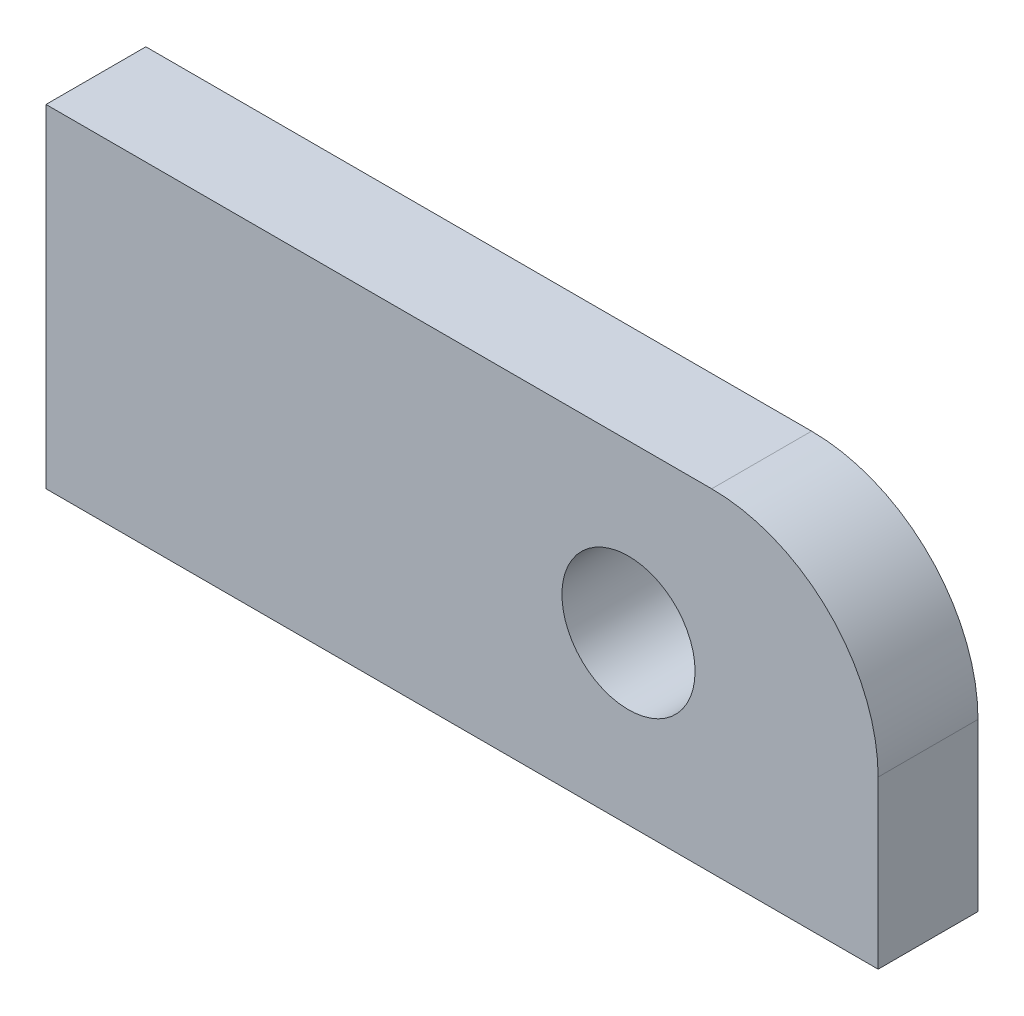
ISO-10303-21;
HEADER;
FILE_DESCRIPTION(('STEP AP214'),'2;1');
FILE_NAME('part.step','',(''),(''),'','','');
FILE_SCHEMA(('AUTOMOTIVE_DESIGN { 1 0 10303 214 1 1 1 1 }'));
ENDSEC;
DATA;
#1=APPLICATION_CONTEXT('core data for automotive mechanical design processes');
#2=APPLICATION_PROTOCOL_DEFINITION('international standard','automotive_design',2000,#1);
#3=PRODUCT_CONTEXT('',#1,'mechanical');
#4=PRODUCT('Part','Part','',(#3));
#5=PRODUCT_RELATED_PRODUCT_CATEGORY('part','',(#4));
#6=PRODUCT_DEFINITION_FORMATION('','',#4);
#7=PRODUCT_DEFINITION_CONTEXT('part definition',#1,'design');
#8=PRODUCT_DEFINITION('design','',#6,#7);
#9=PRODUCT_DEFINITION_SHAPE('','',#8);
#10=(LENGTH_UNIT() NAMED_UNIT(*) SI_UNIT(.MILLI.,.METRE.));
#11=(NAMED_UNIT(*) PLANE_ANGLE_UNIT() SI_UNIT($,.RADIAN.));
#12=(NAMED_UNIT(*) SI_UNIT($,.STERADIAN.) SOLID_ANGLE_UNIT());
#13=UNCERTAINTY_MEASURE_WITH_UNIT(LENGTH_MEASURE(1.E-05),#10,'distance_accuracy_value','');
#14=(GEOMETRIC_REPRESENTATION_CONTEXT(3) GLOBAL_UNCERTAINTY_ASSIGNED_CONTEXT((#13)) GLOBAL_UNIT_ASSIGNED_CONTEXT((#10,
#11,#12)) REPRESENTATION_CONTEXT('',''));
#15=CARTESIAN_POINT('',(0.,0.,0.));
#16=DIRECTION('',(0.,0.,1.));
#17=DIRECTION('',(1.,0.,0.));
#18=AXIS2_PLACEMENT_3D('',#15,#16,#17);
#19=CARTESIAN_POINT('',(80.,19.9999999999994,12.0000000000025));
#20=DIRECTION('',(0.,0.,1.));
#21=DIRECTION('',(1.,0.,0.));
#22=AXIS2_PLACEMENT_3D('',#19,#20,#21);
#23=PLANE('',#22);
#24=DIRECTION('',(0.,-1.,0.));
#25=VECTOR('',#24,1.);
#26=CARTESIAN_POINT('',(0.,0.,12.));
#27=LINE('',#26,#25);
#28=CARTESIAN_POINT('',(-3.88578058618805E-13,40.,12.));
#29=VERTEX_POINT('',#28);
#30=CARTESIAN_POINT('',(0.,0.,12.));
#31=VERTEX_POINT('',#30);
#32=EDGE_CURVE('E107',#29,#31,#27,.T.);
#33=ORIENTED_EDGE('',*,*,#32,.T.);
#34=DIRECTION('',(1.,0.,0.));
#35=VECTOR('',#34,1.);
#36=CARTESIAN_POINT('',(0.,0.,12.));
#37=LINE('',#36,#35);
#38=CARTESIAN_POINT('',(100.,-6.10622663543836E-13,12.0000000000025));
#39=VERTEX_POINT('',#38);
#40=EDGE_CURVE('E90',#31,#39,#37,.T.);
#41=ORIENTED_EDGE('',*,*,#40,.T.);
#42=DIRECTION('',(0.,1.,0.));
#43=VECTOR('',#42,1.);
#44=CARTESIAN_POINT('',(100.,-6.10622663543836E-13,12.0000000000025));
#45=LINE('',#44,#43);
#46=CARTESIAN_POINT('',(100.,19.9999999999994,12.0000000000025));
#47=VERTEX_POINT('',#46);
#48=EDGE_CURVE('E110',#39,#47,#45,.T.);
#49=ORIENTED_EDGE('',*,*,#48,.T.);
#50=CARTESIAN_POINT('',(80.,19.9999999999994,12.0000000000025));
#51=DIRECTION('',(0.,0.,1.));
#52=DIRECTION('',(1.,0.,0.));
#53=AXIS2_PLACEMENT_3D('',#50,#51,#52);
#54=CIRCLE('',#53,20.);
#55=CARTESIAN_POINT('',(80.,40.,12.0000000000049));
#56=VERTEX_POINT('',#55);
#57=EDGE_CURVE('E49',#47,#56,#54,.T.);
#58=ORIENTED_EDGE('',*,*,#57,.T.);
#59=DIRECTION('',(-1.,0.,0.));
#60=VECTOR('',#59,1.);
#61=CARTESIAN_POINT('',(-3.88578058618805E-13,40.,12.));
#62=LINE('',#61,#60);
#63=EDGE_CURVE('E44',#56,#29,#62,.T.);
#64=ORIENTED_EDGE('',*,*,#63,.T.);
#65=EDGE_LOOP('',(#33,#41,#49,#58,#64));
#66=FACE_BOUND('',#65,.T.);
#67=CARTESIAN_POINT('',(70.,19.9999999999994,12.0000000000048));
#68=DIRECTION('',(0.,0.,1.));
#69=DIRECTION('',(1.,0.,0.));
#70=AXIS2_PLACEMENT_3D('',#67,#68,#69);
#71=CIRCLE('',#70,8.00000000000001);
#72=CARTESIAN_POINT('',(78.,19.9999999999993,12.0000000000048));
#73=VERTEX_POINT('',#72);
#74=EDGE_CURVE('E95',#73,#73,#71,.T.);
#75=ORIENTED_EDGE('',*,*,#74,.F.);
#76=EDGE_LOOP('',(#75));
#77=FACE_BOUND('',#76,.T.);
#78=ADVANCED_FACE('F29',(#66,#77),#23,.T.);
#79=CARTESIAN_POINT('',(80.,20.,2.44249065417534E-12));
#80=DIRECTION('',(0.,0.,1.));
#81=DIRECTION('',(1.,0.,0.));
#82=AXIS2_PLACEMENT_3D('',#79,#80,#81);
#83=PLANE('',#82);
#84=DIRECTION('',(0.,-1.,0.));
#85=VECTOR('',#84,1.);
#86=CARTESIAN_POINT('',(0.,0.,0.));
#87=LINE('',#86,#85);
#88=CARTESIAN_POINT('',(0.,40.,0.));
#89=VERTEX_POINT('',#88);
#90=CARTESIAN_POINT('',(0.,0.,0.));
#91=VERTEX_POINT('',#90);
#92=EDGE_CURVE('E81',#89,#91,#87,.T.);
#93=ORIENTED_EDGE('',*,*,#92,.F.);
#94=DIRECTION('',(-1.,0.,0.));
#95=VECTOR('',#94,1.);
#96=CARTESIAN_POINT('',(0.,40.,0.));
#97=LINE('',#96,#95);
#98=CARTESIAN_POINT('',(80.,40.,4.88498130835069E-12));
#99=VERTEX_POINT('',#98);
#100=EDGE_CURVE('E105',#99,#89,#97,.T.);
#101=ORIENTED_EDGE('',*,*,#100,.F.);
#102=CARTESIAN_POINT('',(80.,20.,2.44249065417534E-12));
#103=DIRECTION('',(0.,0.,1.));
#104=DIRECTION('',(1.,0.,0.));
#105=AXIS2_PLACEMENT_3D('',#102,#103,#104);
#106=CIRCLE('',#105,20.);
#107=CARTESIAN_POINT('',(100.,19.9999999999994,2.44249065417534E-12));
#108=VERTEX_POINT('',#107);
#109=EDGE_CURVE('E103',#108,#99,#106,.T.);
#110=ORIENTED_EDGE('',*,*,#109,.F.);
#111=DIRECTION('',(0.,1.,0.));
#112=VECTOR('',#111,1.);
#113=CARTESIAN_POINT('',(100.,-5.96744875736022E-13,2.44249065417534E-12));
#114=LINE('',#113,#112);
#115=CARTESIAN_POINT('',(100.,-5.96744875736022E-13,2.44249065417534E-12));
#116=VERTEX_POINT('',#115);
#117=EDGE_CURVE('E83',#116,#108,#114,.T.);
#118=ORIENTED_EDGE('',*,*,#117,.F.);
#119=DIRECTION('',(1.,0.,0.));
#120=VECTOR('',#119,1.);
#121=CARTESIAN_POINT('',(0.,0.,0.));
#122=LINE('',#121,#120);
#123=EDGE_CURVE('E76',#91,#116,#122,.T.);
#124=ORIENTED_EDGE('',*,*,#123,.F.);
#125=EDGE_LOOP('',(#93,#101,#110,#118,#124));
#126=FACE_BOUND('',#125,.T.);
#127=CARTESIAN_POINT('',(70.,20.,4.88498130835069E-12));
#128=DIRECTION('',(0.,0.,1.));
#129=DIRECTION('',(1.,0.,0.));
#130=AXIS2_PLACEMENT_3D('',#127,#128,#129);
#131=CIRCLE('',#130,8.00000000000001);
#132=CARTESIAN_POINT('',(78.,20.,4.89007487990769E-12));
#133=VERTEX_POINT('',#132);
#134=EDGE_CURVE('E98',#133,#133,#131,.T.);
#135=ORIENTED_EDGE('',*,*,#134,.T.);
#136=EDGE_LOOP('',(#135));
#137=FACE_BOUND('',#136,.T.);
#138=ADVANCED_FACE('F77',(#126,#137),#83,.F.);
#139=CARTESIAN_POINT('',(0.,0.,12.));
#140=DIRECTION('',(1.,0.,0.));
#141=DIRECTION('',(0.,0.,-1.));
#142=AXIS2_PLACEMENT_3D('',#139,#140,#141);
#143=PLANE('',#142);
#144=ORIENTED_EDGE('',*,*,#92,.T.);
#145=DIRECTION('',(0.,0.,-1.));
#146=VECTOR('',#145,1.);
#147=CARTESIAN_POINT('',(0.,0.,12.));
#148=LINE('',#147,#146);
#149=EDGE_CURVE('E11',#31,#91,#148,.T.);
#150=ORIENTED_EDGE('',*,*,#149,.F.);
#151=ORIENTED_EDGE('',*,*,#32,.F.);
#152=DIRECTION('',(0.,0.,-1.));
#153=VECTOR('',#152,1.);
#154=CARTESIAN_POINT('',(-3.88578058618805E-13,40.,12.));
#155=LINE('',#154,#153);
#156=EDGE_CURVE('E94',#29,#89,#155,.T.);
#157=ORIENTED_EDGE('',*,*,#156,.T.);
#158=EDGE_LOOP('',(#144,#150,#151,#157));
#159=FACE_BOUND('',#158,.T.);
#160=ADVANCED_FACE('F31',(#159),#143,.F.);
#161=CARTESIAN_POINT('',(0.,0.,12.));
#162=DIRECTION('',(0.,1.,0.));
#163=DIRECTION('',(0.,0.,1.));
#164=AXIS2_PLACEMENT_3D('',#161,#162,#163);
#165=PLANE('',#164);
#166=ORIENTED_EDGE('',*,*,#123,.T.);
#167=DIRECTION('',(0.,0.,-1.));
#168=VECTOR('',#167,1.);
#169=CARTESIAN_POINT('',(100.,-6.10622663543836E-13,12.0000000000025));
#170=LINE('',#169,#168);
#171=EDGE_CURVE('E37',#39,#116,#170,.T.);
#172=ORIENTED_EDGE('',*,*,#171,.F.);
#173=ORIENTED_EDGE('',*,*,#40,.F.);
#174=ORIENTED_EDGE('',*,*,#149,.T.);
#175=EDGE_LOOP('',(#166,#172,#173,#174));
#176=FACE_BOUND('',#175,.T.);
#177=ADVANCED_FACE('F89',(#176),#165,.F.);
#178=CARTESIAN_POINT('',(100.,-6.10622663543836E-13,12.0000000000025));
#179=DIRECTION('',(-1.,0.,0.));
#180=DIRECTION('',(0.,0.,1.));
#181=AXIS2_PLACEMENT_3D('',#178,#179,#180);
#182=PLANE('',#181);
#183=ORIENTED_EDGE('',*,*,#117,.T.);
#184=DIRECTION('',(0.,0.,-1.));
#185=VECTOR('',#184,1.);
#186=CARTESIAN_POINT('',(100.,19.9999999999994,12.0000000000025));
#187=LINE('',#186,#185);
#188=EDGE_CURVE('E118',#47,#108,#187,.T.);
#189=ORIENTED_EDGE('',*,*,#188,.F.);
#190=ORIENTED_EDGE('',*,*,#48,.F.);
#191=ORIENTED_EDGE('',*,*,#171,.T.);
#192=EDGE_LOOP('',(#183,#189,#190,#191));
#193=FACE_BOUND('',#192,.T.);
#194=ADVANCED_FACE('F122',(#193),#182,.F.);
#195=CARTESIAN_POINT('',(80.,19.9999999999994,12.0000000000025));
#196=DIRECTION('',(0.,0.,-1.));
#197=DIRECTION('',(-1.,0.,0.));
#198=AXIS2_PLACEMENT_3D('',#195,#196,#197);
#199=CYLINDRICAL_SURFACE('',#198,20.);
#200=ORIENTED_EDGE('',*,*,#109,.T.);
#201=DIRECTION('',(0.,0.,-1.));
#202=VECTOR('',#201,1.);
#203=CARTESIAN_POINT('',(80.,40.,12.0000000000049));
#204=LINE('',#203,#202);
#205=EDGE_CURVE('E115',#56,#99,#204,.T.);
#206=ORIENTED_EDGE('',*,*,#205,.F.);
#207=ORIENTED_EDGE('',*,*,#57,.F.);
#208=ORIENTED_EDGE('',*,*,#188,.T.);
#209=EDGE_LOOP('',(#200,#206,#207,#208));
#210=FACE_BOUND('',#209,.T.);
#211=ADVANCED_FACE('F144',(#210),#199,.T.);
#212=CARTESIAN_POINT('',(-3.88578058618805E-13,40.,12.));
#213=DIRECTION('',(0.,-1.,0.));
#214=DIRECTION('',(0.,0.,-1.));
#215=AXIS2_PLACEMENT_3D('',#212,#213,#214);
#216=PLANE('',#215);
#217=ORIENTED_EDGE('',*,*,#100,.T.);
#218=ORIENTED_EDGE('',*,*,#156,.F.);
#219=ORIENTED_EDGE('',*,*,#63,.F.);
#220=ORIENTED_EDGE('',*,*,#205,.T.);
#221=EDGE_LOOP('',(#217,#218,#219,#220));
#222=FACE_BOUND('',#221,.T.);
#223=ADVANCED_FACE('F132',(#222),#216,.F.);
#224=CARTESIAN_POINT('',(70.,19.9999999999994,12.0000000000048));
#225=DIRECTION('',(0.,0.,-1.));
#226=DIRECTION('',(-1.,0.,0.));
#227=AXIS2_PLACEMENT_3D('',#224,#225,#226);
#228=CYLINDRICAL_SURFACE('',#227,8.00000000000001);
#229=ORIENTED_EDGE('',*,*,#74,.T.);
#230=EDGE_LOOP('',(#229));
#231=FACE_BOUND('',#230,.T.);
#232=ORIENTED_EDGE('',*,*,#134,.F.);
#233=EDGE_LOOP('',(#232));
#234=FACE_BOUND('',#233,.T.);
#235=ADVANCED_FACE('F129',(#231,#234),#228,.F.);
#236=CLOSED_SHELL('',(#78,#138,#160,#177,#194,#211,#223,#235));
#237=MANIFOLD_SOLID_BREP('B2',#236);
#238=ADVANCED_BREP_SHAPE_REPRESENTATION('',(#18,#237),#14);
#239=SHAPE_DEFINITION_REPRESENTATION(#9,#238);
ENDSEC;
END-ISO-10303-21;
